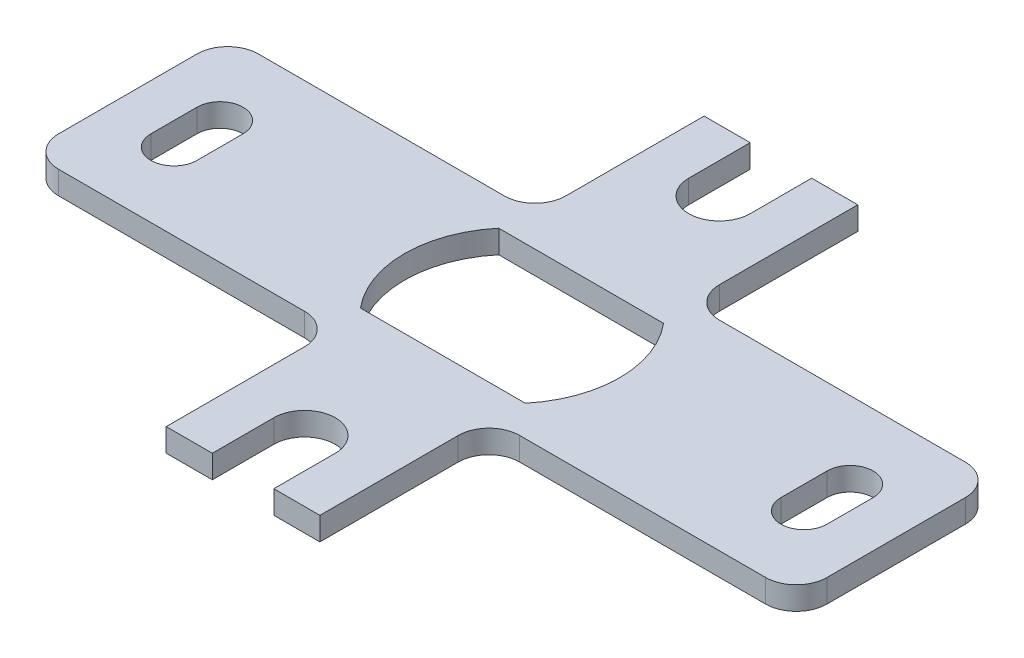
ISO-10303-21;
HEADER;
FILE_DESCRIPTION(('STEP AP214'),'2;1');
FILE_NAME('part.step','',(''),(''),'','','');
FILE_SCHEMA(('AUTOMOTIVE_DESIGN { 1 0 10303 214 1 1 1 1 }'));
ENDSEC;
DATA;
#1=APPLICATION_CONTEXT('core data for automotive mechanical design processes');
#2=APPLICATION_PROTOCOL_DEFINITION('international standard','automotive_design',2000,#1);
#3=PRODUCT_CONTEXT('',#1,'mechanical');
#4=PRODUCT('Part','Part','',(#3));
#5=PRODUCT_RELATED_PRODUCT_CATEGORY('part','',(#4));
#6=PRODUCT_DEFINITION_FORMATION('','',#4);
#7=PRODUCT_DEFINITION_CONTEXT('part definition',#1,'design');
#8=PRODUCT_DEFINITION('design','',#6,#7);
#9=PRODUCT_DEFINITION_SHAPE('','',#8);
#10=(LENGTH_UNIT() NAMED_UNIT(*) SI_UNIT(.MILLI.,.METRE.));
#11=(NAMED_UNIT(*) PLANE_ANGLE_UNIT() SI_UNIT($,.RADIAN.));
#12=(NAMED_UNIT(*) SI_UNIT($,.STERADIAN.) SOLID_ANGLE_UNIT());
#13=UNCERTAINTY_MEASURE_WITH_UNIT(LENGTH_MEASURE(1.E-05),#10,'distance_accuracy_value','');
#14=(GEOMETRIC_REPRESENTATION_CONTEXT(3) GLOBAL_UNCERTAINTY_ASSIGNED_CONTEXT((#13)) GLOBAL_UNIT_ASSIGNED_CONTEXT((#10,
#11,#12)) REPRESENTATION_CONTEXT('',''));
#15=CARTESIAN_POINT('',(0.,0.,0.));
#16=DIRECTION('',(0.,0.,1.));
#17=DIRECTION('',(1.,0.,0.));
#18=AXIS2_PLACEMENT_3D('',#15,#16,#17);
#19=CARTESIAN_POINT('',(4.,3.,-26.));
#20=DIRECTION('',(0.,1.,0.));
#21=DIRECTION('',(0.,0.,1.));
#22=AXIS2_PLACEMENT_3D('',#19,#20,#21);
#23=PLANE('',#22);
#24=DIRECTION('',(0.,0.,1.));
#25=VECTOR('',#24,1.);
#26=CARTESIAN_POINT('',(88.,3.,-32.));
#27=LINE('',#26,#25);
#28=CARTESIAN_POINT('',(88.,3.,-38.));
#29=VERTEX_POINT('',#28);
#30=CARTESIAN_POINT('',(88.,3.,-32.));
#31=VERTEX_POINT('',#30);
#32=EDGE_CURVE('E326',#29,#31,#27,.T.);
#33=ORIENTED_EDGE('',*,*,#32,.F.);
#34=CARTESIAN_POINT('',(91.,3.,-38.));
#35=DIRECTION('',(0.,1.,0.));
#36=DIRECTION('',(0.,0.,1.));
#37=AXIS2_PLACEMENT_3D('',#34,#35,#36);
#38=CIRCLE('',#37,3.);
#39=CARTESIAN_POINT('',(94.,3.,-38.));
#40=VERTEX_POINT('',#39);
#41=EDGE_CURVE('E324',#40,#29,#38,.T.);
#42=ORIENTED_EDGE('',*,*,#41,.F.);
#43=DIRECTION('',(0.,0.,-1.));
#44=VECTOR('',#43,1.);
#45=CARTESIAN_POINT('',(94.,3.,-38.));
#46=LINE('',#45,#44);
#47=CARTESIAN_POINT('',(94.,3.,-32.));
#48=VERTEX_POINT('',#47);
#49=EDGE_CURVE('E332',#48,#40,#46,.T.);
#50=ORIENTED_EDGE('',*,*,#49,.F.);
#51=CARTESIAN_POINT('',(91.,3.,-32.));
#52=DIRECTION('',(0.,1.,0.));
#53=DIRECTION('',(0.,0.,1.));
#54=AXIS2_PLACEMENT_3D('',#51,#52,#53);
#55=CIRCLE('',#54,3.);
#56=EDGE_CURVE('E329',#31,#48,#55,.T.);
#57=ORIENTED_EDGE('',*,*,#56,.F.);
#58=EDGE_LOOP('',(#33,#42,#50,#57));
#59=FACE_BOUND('',#58,.T.);
#60=CARTESIAN_POINT('',(4.,3.,-26.));
#61=DIRECTION('',(0.,1.,0.));
#62=DIRECTION('',(0.,0.,1.));
#63=AXIS2_PLACEMENT_3D('',#60,#61,#62);
#64=CIRCLE('',#63,4.);
#65=CARTESIAN_POINT('',(0.,3.,-26.));
#66=VERTEX_POINT('',#65);
#67=CARTESIAN_POINT('',(4.,3.,-22.));
#68=VERTEX_POINT('',#67);
#69=EDGE_CURVE('E386',#66,#68,#64,.T.);
#70=ORIENTED_EDGE('',*,*,#69,.T.);
#71=DIRECTION('',(1.,0.,0.));
#72=VECTOR('',#71,1.);
#73=CARTESIAN_POINT('',(4.,3.,-22.));
#74=LINE('',#73,#72);
#75=CARTESIAN_POINT('',(36.,3.,-22.));
#76=VERTEX_POINT('',#75);
#77=EDGE_CURVE('E389',#68,#76,#74,.T.);
#78=ORIENTED_EDGE('',*,*,#77,.T.);
#79=CARTESIAN_POINT('',(36.,3.,-18.));
#80=DIRECTION('',(0.,-1.,0.));
#81=DIRECTION('',(0.,0.,1.));
#82=AXIS2_PLACEMENT_3D('',#79,#80,#81);
#83=CIRCLE('',#82,4.);
#84=CARTESIAN_POINT('',(40.,3.,-18.));
#85=VERTEX_POINT('',#84);
#86=EDGE_CURVE('E392',#76,#85,#83,.T.);
#87=ORIENTED_EDGE('',*,*,#86,.T.);
#88=DIRECTION('',(0.,0.,1.));
#89=VECTOR('',#88,1.);
#90=CARTESIAN_POINT('',(40.,3.,0.));
#91=LINE('',#90,#89);
#92=CARTESIAN_POINT('',(40.,3.,0.));
#93=VERTEX_POINT('',#92);
#94=EDGE_CURVE('E394',#85,#93,#91,.T.);
#95=ORIENTED_EDGE('',*,*,#94,.T.);
#96=DIRECTION('',(1.,0.,0.));
#97=VECTOR('',#96,1.);
#98=CARTESIAN_POINT('',(40.,3.,0.));
#99=LINE('',#98,#97);
#100=CARTESIAN_POINT('',(46.,3.,0.));
#101=VERTEX_POINT('',#100);
#102=EDGE_CURVE('E396',#93,#101,#99,.T.);
#103=ORIENTED_EDGE('',*,*,#102,.T.);
#104=DIRECTION('',(0.,0.,-1.));
#105=VECTOR('',#104,1.);
#106=CARTESIAN_POINT('',(46.,3.,-8.));
#107=LINE('',#106,#105);
#108=CARTESIAN_POINT('',(46.,3.,-8.));
#109=VERTEX_POINT('',#108);
#110=EDGE_CURVE('E398',#101,#109,#107,.T.);
#111=ORIENTED_EDGE('',*,*,#110,.T.);
#112=CARTESIAN_POINT('',(50.,3.,-8.));
#113=DIRECTION('',(0.,-1.,0.));
#114=DIRECTION('',(0.,0.,1.));
#115=AXIS2_PLACEMENT_3D('',#112,#113,#114);
#116=CIRCLE('',#115,4.);
#117=CARTESIAN_POINT('',(54.,3.,-8.));
#118=VERTEX_POINT('',#117);
#119=EDGE_CURVE('E400',#109,#118,#116,.T.);
#120=ORIENTED_EDGE('',*,*,#119,.T.);
#121=DIRECTION('',(0.,0.,1.));
#122=VECTOR('',#121,1.);
#123=CARTESIAN_POINT('',(54.,3.,-8.));
#124=LINE('',#123,#122);
#125=CARTESIAN_POINT('',(54.,3.,0.));
#126=VERTEX_POINT('',#125);
#127=EDGE_CURVE('E402',#118,#126,#124,.T.);
#128=ORIENTED_EDGE('',*,*,#127,.T.);
#129=DIRECTION('',(1.,0.,0.));
#130=VECTOR('',#129,1.);
#131=CARTESIAN_POINT('',(54.,3.,0.));
#132=LINE('',#131,#130);
#133=CARTESIAN_POINT('',(60.,3.,0.));
#134=VERTEX_POINT('',#133);
#135=EDGE_CURVE('E404',#126,#134,#132,.T.);
#136=ORIENTED_EDGE('',*,*,#135,.T.);
#137=DIRECTION('',(0.,0.,-1.));
#138=VECTOR('',#137,1.);
#139=CARTESIAN_POINT('',(60.,3.,-18.));
#140=LINE('',#139,#138);
#141=CARTESIAN_POINT('',(60.,3.,-18.));
#142=VERTEX_POINT('',#141);
#143=EDGE_CURVE('E406',#134,#142,#140,.T.);
#144=ORIENTED_EDGE('',*,*,#143,.T.);
#145=CARTESIAN_POINT('',(64.,3.,-18.));
#146=DIRECTION('',(0.,-1.,0.));
#147=DIRECTION('',(0.,0.,-1.));
#148=AXIS2_PLACEMENT_3D('',#145,#146,#147);
#149=CIRCLE('',#148,4.00000000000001);
#150=CARTESIAN_POINT('',(64.,3.,-22.));
#151=VERTEX_POINT('',#150);
#152=EDGE_CURVE('E408',#142,#151,#149,.T.);
#153=ORIENTED_EDGE('',*,*,#152,.T.);
#154=DIRECTION('',(1.,0.,0.));
#155=VECTOR('',#154,1.);
#156=CARTESIAN_POINT('',(64.,3.,-22.));
#157=LINE('',#156,#155);
#158=CARTESIAN_POINT('',(96.,3.,-22.));
#159=VERTEX_POINT('',#158);
#160=EDGE_CURVE('E410',#151,#159,#157,.T.);
#161=ORIENTED_EDGE('',*,*,#160,.T.);
#162=CARTESIAN_POINT('',(96.,3.,-26.));
#163=DIRECTION('',(0.,1.,0.));
#164=DIRECTION('',(0.,0.,1.));
#165=AXIS2_PLACEMENT_3D('',#162,#163,#164);
#166=CIRCLE('',#165,4.);
#167=CARTESIAN_POINT('',(100.,3.,-26.));
#168=VERTEX_POINT('',#167);
#169=EDGE_CURVE('E412',#159,#168,#166,.T.);
#170=ORIENTED_EDGE('',*,*,#169,.T.);
#171=DIRECTION('',(0.,0.,-1.));
#172=VECTOR('',#171,1.);
#173=CARTESIAN_POINT('',(100.,3.,-26.));
#174=LINE('',#173,#172);
#175=CARTESIAN_POINT('',(100.,3.,-44.));
#176=VERTEX_POINT('',#175);
#177=EDGE_CURVE('E414',#168,#176,#174,.T.);
#178=ORIENTED_EDGE('',*,*,#177,.T.);
#179=CARTESIAN_POINT('',(96.,3.,-44.));
#180=DIRECTION('',(0.,1.,0.));
#181=DIRECTION('',(0.,0.,1.));
#182=AXIS2_PLACEMENT_3D('',#179,#180,#181);
#183=CIRCLE('',#182,4.);
#184=CARTESIAN_POINT('',(96.,3.,-48.));
#185=VERTEX_POINT('',#184);
#186=EDGE_CURVE('E416',#176,#185,#183,.T.);
#187=ORIENTED_EDGE('',*,*,#186,.T.);
#188=DIRECTION('',(-1.,0.,0.));
#189=VECTOR('',#188,1.);
#190=CARTESIAN_POINT('',(64.,3.,-48.));
#191=LINE('',#190,#189);
#192=CARTESIAN_POINT('',(64.,3.,-48.));
#193=VERTEX_POINT('',#192);
#194=EDGE_CURVE('E418',#185,#193,#191,.T.);
#195=ORIENTED_EDGE('',*,*,#194,.T.);
#196=CARTESIAN_POINT('',(64.,3.,-52.));
#197=DIRECTION('',(0.,-1.,0.));
#198=DIRECTION('',(0.,0.,-1.));
#199=AXIS2_PLACEMENT_3D('',#196,#197,#198);
#200=CIRCLE('',#199,4.);
#201=CARTESIAN_POINT('',(60.,3.,-52.));
#202=VERTEX_POINT('',#201);
#203=EDGE_CURVE('E420',#193,#202,#200,.T.);
#204=ORIENTED_EDGE('',*,*,#203,.T.);
#205=DIRECTION('',(0.,0.,-1.));
#206=VECTOR('',#205,1.);
#207=CARTESIAN_POINT('',(60.,3.,-70.));
#208=LINE('',#207,#206);
#209=CARTESIAN_POINT('',(60.,3.,-70.));
#210=VERTEX_POINT('',#209);
#211=EDGE_CURVE('E422',#202,#210,#208,.T.);
#212=ORIENTED_EDGE('',*,*,#211,.T.);
#213=DIRECTION('',(-1.,0.,0.));
#214=VECTOR('',#213,1.);
#215=CARTESIAN_POINT('',(54.,3.,-70.));
#216=LINE('',#215,#214);
#217=CARTESIAN_POINT('',(54.,3.,-70.));
#218=VERTEX_POINT('',#217);
#219=EDGE_CURVE('E424',#210,#218,#216,.T.);
#220=ORIENTED_EDGE('',*,*,#219,.T.);
#221=DIRECTION('',(0.,0.,1.));
#222=VECTOR('',#221,1.);
#223=CARTESIAN_POINT('',(54.,3.,-62.));
#224=LINE('',#223,#222);
#225=CARTESIAN_POINT('',(54.,3.,-62.));
#226=VERTEX_POINT('',#225);
#227=EDGE_CURVE('E426',#218,#226,#224,.T.);
#228=ORIENTED_EDGE('',*,*,#227,.T.);
#229=CARTESIAN_POINT('',(50.,3.,-62.));
#230=DIRECTION('',(0.,-1.,0.));
#231=DIRECTION('',(0.,0.,1.));
#232=AXIS2_PLACEMENT_3D('',#229,#230,#231);
#233=CIRCLE('',#232,3.99999999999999);
#234=CARTESIAN_POINT('',(46.,3.,-62.));
#235=VERTEX_POINT('',#234);
#236=EDGE_CURVE('E428',#226,#235,#233,.T.);
#237=ORIENTED_EDGE('',*,*,#236,.T.);
#238=DIRECTION('',(0.,0.,-1.));
#239=VECTOR('',#238,1.);
#240=CARTESIAN_POINT('',(46.,3.,-62.));
#241=LINE('',#240,#239);
#242=CARTESIAN_POINT('',(46.,3.,-70.));
#243=VERTEX_POINT('',#242);
#244=EDGE_CURVE('E430',#235,#243,#241,.T.);
#245=ORIENTED_EDGE('',*,*,#244,.T.);
#246=DIRECTION('',(-1.,0.,0.));
#247=VECTOR('',#246,1.);
#248=CARTESIAN_POINT('',(46.,3.,-70.));
#249=LINE('',#248,#247);
#250=CARTESIAN_POINT('',(40.,3.,-70.));
#251=VERTEX_POINT('',#250);
#252=EDGE_CURVE('E432',#243,#251,#249,.T.);
#253=ORIENTED_EDGE('',*,*,#252,.T.);
#254=DIRECTION('',(0.,0.,1.));
#255=VECTOR('',#254,1.);
#256=CARTESIAN_POINT('',(40.,3.,-52.));
#257=LINE('',#256,#255);
#258=CARTESIAN_POINT('',(40.,3.,-52.));
#259=VERTEX_POINT('',#258);
#260=EDGE_CURVE('E434',#251,#259,#257,.T.);
#261=ORIENTED_EDGE('',*,*,#260,.T.);
#262=CARTESIAN_POINT('',(36.,3.,-52.));
#263=DIRECTION('',(0.,-1.,0.));
#264=DIRECTION('',(0.,0.,-1.));
#265=AXIS2_PLACEMENT_3D('',#262,#263,#264);
#266=CIRCLE('',#265,3.99999999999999);
#267=CARTESIAN_POINT('',(36.,3.,-48.));
#268=VERTEX_POINT('',#267);
#269=EDGE_CURVE('E436',#259,#268,#266,.T.);
#270=ORIENTED_EDGE('',*,*,#269,.T.);
#271=DIRECTION('',(-1.,0.,0.));
#272=VECTOR('',#271,1.);
#273=CARTESIAN_POINT('',(4.,3.,-48.));
#274=LINE('',#273,#272);
#275=CARTESIAN_POINT('',(4.,3.,-48.));
#276=VERTEX_POINT('',#275);
#277=EDGE_CURVE('E438',#268,#276,#274,.T.);
#278=ORIENTED_EDGE('',*,*,#277,.T.);
#279=CARTESIAN_POINT('',(4.,3.,-44.));
#280=DIRECTION('',(0.,1.,0.));
#281=DIRECTION('',(0.,0.,1.));
#282=AXIS2_PLACEMENT_3D('',#279,#280,#281);
#283=CIRCLE('',#282,4.);
#284=CARTESIAN_POINT('',(0.,3.,-44.));
#285=VERTEX_POINT('',#284);
#286=EDGE_CURVE('E440',#276,#285,#283,.T.);
#287=ORIENTED_EDGE('',*,*,#286,.T.);
#288=DIRECTION('',(0.,0.,1.));
#289=VECTOR('',#288,1.);
#290=CARTESIAN_POINT('',(0.,3.,-26.));
#291=LINE('',#290,#289);
#292=EDGE_CURVE('E442',#285,#66,#291,.T.);
#293=ORIENTED_EDGE('',*,*,#292,.T.);
#294=EDGE_LOOP('',(#70,#78,#87,#95,#103,#111,#120,#128,#136,#144,#153,#161,#170,#178,#187,#195,
#204,#212,#220,#228,#237,#245,#253,#261,#270,#278,#287,#293));
#295=FACE_BOUND('',#294,.T.);
#296=DIRECTION('',(1.,0.,0.));
#297=VECTOR('',#296,1.);
#298=CARTESIAN_POINT('',(60.7238052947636,3.,-26.));
#299=LINE('',#298,#297);
#300=CARTESIAN_POINT('',(39.2761947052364,3.,-26.));
#301=VERTEX_POINT('',#300);
#302=CARTESIAN_POINT('',(60.7238052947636,3.,-26.));
#303=VERTEX_POINT('',#302);
#304=EDGE_CURVE('E357',#301,#303,#299,.T.);
#305=ORIENTED_EDGE('',*,*,#304,.F.);
#306=CARTESIAN_POINT('',(50.,3.,-35.));
#307=DIRECTION('',(0.,1.,0.));
#308=DIRECTION('',(0.,0.,1.));
#309=AXIS2_PLACEMENT_3D('',#306,#307,#308);
#310=CIRCLE('',#309,14.);
#311=CARTESIAN_POINT('',(39.2761947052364,3.,-44.));
#312=VERTEX_POINT('',#311);
#313=EDGE_CURVE('E355',#312,#301,#310,.T.);
#314=ORIENTED_EDGE('',*,*,#313,.F.);
#315=DIRECTION('',(-1.,0.,0.));
#316=VECTOR('',#315,1.);
#317=CARTESIAN_POINT('',(39.2761947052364,3.,-44.));
#318=LINE('',#317,#316);
#319=CARTESIAN_POINT('',(60.7238052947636,3.,-44.));
#320=VERTEX_POINT('',#319);
#321=EDGE_CURVE('E363',#320,#312,#318,.T.);
#322=ORIENTED_EDGE('',*,*,#321,.F.);
#323=CARTESIAN_POINT('',(50.,3.,-35.));
#324=DIRECTION('',(0.,1.,0.));
#325=DIRECTION('',(0.,0.,1.));
#326=AXIS2_PLACEMENT_3D('',#323,#324,#325);
#327=CIRCLE('',#326,14.);
#328=EDGE_CURVE('E360',#303,#320,#327,.T.);
#329=ORIENTED_EDGE('',*,*,#328,.F.);
#330=EDGE_LOOP('',(#305,#314,#322,#329));
#331=FACE_BOUND('',#330,.T.);
#332=DIRECTION('',(0.,0.,1.));
#333=VECTOR('',#332,1.);
#334=CARTESIAN_POINT('',(6.,3.,-38.));
#335=LINE('',#334,#333);
#336=CARTESIAN_POINT('',(6.,3.,-38.));
#337=VERTEX_POINT('',#336);
#338=CARTESIAN_POINT('',(6.,3.,-32.));
#339=VERTEX_POINT('',#338);
#340=EDGE_CURVE('E296',#337,#339,#335,.T.);
#341=ORIENTED_EDGE('',*,*,#340,.F.);
#342=CARTESIAN_POINT('',(8.99999999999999,3.,-38.));
#343=DIRECTION('',(0.,1.,0.));
#344=DIRECTION('',(0.,0.,1.));
#345=AXIS2_PLACEMENT_3D('',#342,#343,#344);
#346=CIRCLE('',#345,3.);
#347=CARTESIAN_POINT('',(12.,3.,-38.));
#348=VERTEX_POINT('',#347);
#349=EDGE_CURVE('E288',#348,#337,#346,.T.);
#350=ORIENTED_EDGE('',*,*,#349,.F.);
#351=DIRECTION('',(0.,0.,-1.));
#352=VECTOR('',#351,1.);
#353=CARTESIAN_POINT('',(12.,3.,-38.));
#354=LINE('',#353,#352);
#355=CARTESIAN_POINT('',(12.,3.,-32.));
#356=VERTEX_POINT('',#355);
#357=EDGE_CURVE('E310',#356,#348,#354,.T.);
#358=ORIENTED_EDGE('',*,*,#357,.F.);
#359=CARTESIAN_POINT('',(9.,3.,-32.));
#360=DIRECTION('',(0.,1.,0.));
#361=DIRECTION('',(0.,0.,1.));
#362=AXIS2_PLACEMENT_3D('',#359,#360,#361);
#363=CIRCLE('',#362,3.);
#364=EDGE_CURVE('E308',#339,#356,#363,.T.);
#365=ORIENTED_EDGE('',*,*,#364,.F.);
#366=EDGE_LOOP('',(#341,#350,#358,#365));
#367=FACE_BOUND('',#366,.T.);
#368=ADVANCED_FACE('F31',(#59,#295,#331,#367),#23,.T.);
#369=CARTESIAN_POINT('',(4.,0.,-26.));
#370=DIRECTION('',(0.,1.,0.));
#371=DIRECTION('',(0.,0.,1.));
#372=AXIS2_PLACEMENT_3D('',#369,#370,#371);
#373=PLANE('',#372);
#374=CARTESIAN_POINT('',(91.,0.,-38.));
#375=DIRECTION('',(0.,1.,0.));
#376=DIRECTION('',(0.,0.,1.));
#377=AXIS2_PLACEMENT_3D('',#374,#375,#376);
#378=CIRCLE('',#377,3.);
#379=CARTESIAN_POINT('',(94.,0.,-38.));
#380=VERTEX_POINT('',#379);
#381=CARTESIAN_POINT('',(88.,0.,-38.));
#382=VERTEX_POINT('',#381);
#383=EDGE_CURVE('E304',#380,#382,#378,.T.);
#384=ORIENTED_EDGE('',*,*,#383,.T.);
#385=DIRECTION('',(0.,0.,1.));
#386=VECTOR('',#385,1.);
#387=CARTESIAN_POINT('',(88.,0.,-32.));
#388=LINE('',#387,#386);
#389=CARTESIAN_POINT('',(88.,0.,-32.));
#390=VERTEX_POINT('',#389);
#391=EDGE_CURVE('E337',#382,#390,#388,.T.);
#392=ORIENTED_EDGE('',*,*,#391,.T.);
#393=CARTESIAN_POINT('',(91.,0.,-32.));
#394=DIRECTION('',(0.,1.,0.));
#395=DIRECTION('',(0.,0.,1.));
#396=AXIS2_PLACEMENT_3D('',#393,#394,#395);
#397=CIRCLE('',#396,3.);
#398=CARTESIAN_POINT('',(94.,0.,-32.));
#399=VERTEX_POINT('',#398);
#400=EDGE_CURVE('E340',#390,#399,#397,.T.);
#401=ORIENTED_EDGE('',*,*,#400,.T.);
#402=DIRECTION('',(0.,0.,-1.));
#403=VECTOR('',#402,1.);
#404=CARTESIAN_POINT('',(94.,0.,-38.));
#405=LINE('',#404,#403);
#406=EDGE_CURVE('E327',#399,#380,#405,.T.);
#407=ORIENTED_EDGE('',*,*,#406,.T.);
#408=EDGE_LOOP('',(#384,#392,#401,#407));
#409=FACE_BOUND('',#408,.T.);
#410=CARTESIAN_POINT('',(4.,0.,-26.));
#411=DIRECTION('',(0.,1.,0.));
#412=DIRECTION('',(0.,0.,1.));
#413=AXIS2_PLACEMENT_3D('',#410,#411,#412);
#414=CIRCLE('',#413,4.);
#415=CARTESIAN_POINT('',(0.,0.,-26.));
#416=VERTEX_POINT('',#415);
#417=CARTESIAN_POINT('',(4.,0.,-22.));
#418=VERTEX_POINT('',#417);
#419=EDGE_CURVE('E385',#416,#418,#414,.T.);
#420=ORIENTED_EDGE('',*,*,#419,.F.);
#421=DIRECTION('',(0.,0.,1.));
#422=VECTOR('',#421,1.);
#423=CARTESIAN_POINT('',(0.,0.,-26.));
#424=LINE('',#423,#422);
#425=CARTESIAN_POINT('',(0.,0.,-44.));
#426=VERTEX_POINT('',#425);
#427=EDGE_CURVE('E390',#426,#416,#424,.T.);
#428=ORIENTED_EDGE('',*,*,#427,.F.);
#429=CARTESIAN_POINT('',(4.,0.,-44.));
#430=DIRECTION('',(0.,1.,0.));
#431=DIRECTION('',(0.,0.,1.));
#432=AXIS2_PLACEMENT_3D('',#429,#430,#431);
#433=CIRCLE('',#432,4.);
#434=CARTESIAN_POINT('',(4.,0.,-48.));
#435=VERTEX_POINT('',#434);
#436=EDGE_CURVE('E497',#435,#426,#433,.T.);
#437=ORIENTED_EDGE('',*,*,#436,.F.);
#438=DIRECTION('',(-1.,0.,0.));
#439=VECTOR('',#438,1.);
#440=CARTESIAN_POINT('',(4.,0.,-48.));
#441=LINE('',#440,#439);
#442=CARTESIAN_POINT('',(36.,0.,-48.));
#443=VERTEX_POINT('',#442);
#444=EDGE_CURVE('E495',#443,#435,#441,.T.);
#445=ORIENTED_EDGE('',*,*,#444,.F.);
#446=CARTESIAN_POINT('',(36.,0.,-52.));
#447=DIRECTION('',(0.,-1.,0.));
#448=DIRECTION('',(0.,0.,-1.));
#449=AXIS2_PLACEMENT_3D('',#446,#447,#448);
#450=CIRCLE('',#449,3.99999999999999);
#451=CARTESIAN_POINT('',(40.,0.,-52.));
#452=VERTEX_POINT('',#451);
#453=EDGE_CURVE('E493',#452,#443,#450,.T.);
#454=ORIENTED_EDGE('',*,*,#453,.F.);
#455=DIRECTION('',(0.,0.,1.));
#456=VECTOR('',#455,1.);
#457=CARTESIAN_POINT('',(40.,0.,-52.));
#458=LINE('',#457,#456);
#459=CARTESIAN_POINT('',(40.,0.,-70.));
#460=VERTEX_POINT('',#459);
#461=EDGE_CURVE('E491',#460,#452,#458,.T.);
#462=ORIENTED_EDGE('',*,*,#461,.F.);
#463=DIRECTION('',(-1.,0.,0.));
#464=VECTOR('',#463,1.);
#465=CARTESIAN_POINT('',(46.,0.,-70.));
#466=LINE('',#465,#464);
#467=CARTESIAN_POINT('',(46.,0.,-70.));
#468=VERTEX_POINT('',#467);
#469=EDGE_CURVE('E489',#468,#460,#466,.T.);
#470=ORIENTED_EDGE('',*,*,#469,.F.);
#471=DIRECTION('',(0.,0.,-1.));
#472=VECTOR('',#471,1.);
#473=CARTESIAN_POINT('',(46.,0.,-62.));
#474=LINE('',#473,#472);
#475=CARTESIAN_POINT('',(46.,0.,-62.));
#476=VERTEX_POINT('',#475);
#477=EDGE_CURVE('E487',#476,#468,#474,.T.);
#478=ORIENTED_EDGE('',*,*,#477,.F.);
#479=CARTESIAN_POINT('',(50.,0.,-62.));
#480=DIRECTION('',(0.,-1.,0.));
#481=DIRECTION('',(0.,0.,1.));
#482=AXIS2_PLACEMENT_3D('',#479,#480,#481);
#483=CIRCLE('',#482,3.99999999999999);
#484=CARTESIAN_POINT('',(54.,0.,-62.));
#485=VERTEX_POINT('',#484);
#486=EDGE_CURVE('E485',#485,#476,#483,.T.);
#487=ORIENTED_EDGE('',*,*,#486,.F.);
#488=DIRECTION('',(0.,0.,1.));
#489=VECTOR('',#488,1.);
#490=CARTESIAN_POINT('',(54.,0.,-62.));
#491=LINE('',#490,#489);
#492=CARTESIAN_POINT('',(54.,0.,-70.));
#493=VERTEX_POINT('',#492);
#494=EDGE_CURVE('E483',#493,#485,#491,.T.);
#495=ORIENTED_EDGE('',*,*,#494,.F.);
#496=DIRECTION('',(-1.,0.,0.));
#497=VECTOR('',#496,1.);
#498=CARTESIAN_POINT('',(54.,0.,-70.));
#499=LINE('',#498,#497);
#500=CARTESIAN_POINT('',(60.,0.,-70.));
#501=VERTEX_POINT('',#500);
#502=EDGE_CURVE('E481',#501,#493,#499,.T.);
#503=ORIENTED_EDGE('',*,*,#502,.F.);
#504=DIRECTION('',(0.,0.,-1.));
#505=VECTOR('',#504,1.);
#506=CARTESIAN_POINT('',(60.,0.,-70.));
#507=LINE('',#506,#505);
#508=CARTESIAN_POINT('',(60.,0.,-52.));
#509=VERTEX_POINT('',#508);
#510=EDGE_CURVE('E479',#509,#501,#507,.T.);
#511=ORIENTED_EDGE('',*,*,#510,.F.);
#512=CARTESIAN_POINT('',(64.,0.,-52.));
#513=DIRECTION('',(0.,-1.,0.));
#514=DIRECTION('',(0.,0.,-1.));
#515=AXIS2_PLACEMENT_3D('',#512,#513,#514);
#516=CIRCLE('',#515,4.);
#517=CARTESIAN_POINT('',(64.,0.,-48.));
#518=VERTEX_POINT('',#517);
#519=EDGE_CURVE('E477',#518,#509,#516,.T.);
#520=ORIENTED_EDGE('',*,*,#519,.F.);
#521=DIRECTION('',(-1.,0.,0.));
#522=VECTOR('',#521,1.);
#523=CARTESIAN_POINT('',(64.,0.,-48.));
#524=LINE('',#523,#522);
#525=CARTESIAN_POINT('',(96.,0.,-48.));
#526=VERTEX_POINT('',#525);
#527=EDGE_CURVE('E475',#526,#518,#524,.T.);
#528=ORIENTED_EDGE('',*,*,#527,.F.);
#529=CARTESIAN_POINT('',(96.,0.,-44.));
#530=DIRECTION('',(0.,1.,0.));
#531=DIRECTION('',(0.,0.,1.));
#532=AXIS2_PLACEMENT_3D('',#529,#530,#531);
#533=CIRCLE('',#532,4.);
#534=CARTESIAN_POINT('',(100.,0.,-44.));
#535=VERTEX_POINT('',#534);
#536=EDGE_CURVE('E473',#535,#526,#533,.T.);
#537=ORIENTED_EDGE('',*,*,#536,.F.);
#538=DIRECTION('',(0.,0.,-1.));
#539=VECTOR('',#538,1.);
#540=CARTESIAN_POINT('',(100.,0.,-26.));
#541=LINE('',#540,#539);
#542=CARTESIAN_POINT('',(100.,0.,-26.));
#543=VERTEX_POINT('',#542);
#544=EDGE_CURVE('E471',#543,#535,#541,.T.);
#545=ORIENTED_EDGE('',*,*,#544,.F.);
#546=CARTESIAN_POINT('',(96.,0.,-26.));
#547=DIRECTION('',(0.,1.,0.));
#548=DIRECTION('',(0.,0.,1.));
#549=AXIS2_PLACEMENT_3D('',#546,#547,#548);
#550=CIRCLE('',#549,4.);
#551=CARTESIAN_POINT('',(96.,0.,-22.));
#552=VERTEX_POINT('',#551);
#553=EDGE_CURVE('E469',#552,#543,#550,.T.);
#554=ORIENTED_EDGE('',*,*,#553,.F.);
#555=DIRECTION('',(1.,0.,0.));
#556=VECTOR('',#555,1.);
#557=CARTESIAN_POINT('',(64.,0.,-22.));
#558=LINE('',#557,#556);
#559=CARTESIAN_POINT('',(64.,0.,-22.));
#560=VERTEX_POINT('',#559);
#561=EDGE_CURVE('E467',#560,#552,#558,.T.);
#562=ORIENTED_EDGE('',*,*,#561,.F.);
#563=CARTESIAN_POINT('',(64.,0.,-18.));
#564=DIRECTION('',(0.,-1.,0.));
#565=DIRECTION('',(0.,0.,-1.));
#566=AXIS2_PLACEMENT_3D('',#563,#564,#565);
#567=CIRCLE('',#566,4.00000000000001);
#568=CARTESIAN_POINT('',(60.,0.,-18.));
#569=VERTEX_POINT('',#568);
#570=EDGE_CURVE('E465',#569,#560,#567,.T.);
#571=ORIENTED_EDGE('',*,*,#570,.F.);
#572=DIRECTION('',(0.,0.,-1.));
#573=VECTOR('',#572,1.);
#574=CARTESIAN_POINT('',(60.,0.,-18.));
#575=LINE('',#574,#573);
#576=CARTESIAN_POINT('',(60.,0.,0.));
#577=VERTEX_POINT('',#576);
#578=EDGE_CURVE('E463',#577,#569,#575,.T.);
#579=ORIENTED_EDGE('',*,*,#578,.F.);
#580=DIRECTION('',(1.,0.,0.));
#581=VECTOR('',#580,1.);
#582=CARTESIAN_POINT('',(54.,0.,0.));
#583=LINE('',#582,#581);
#584=CARTESIAN_POINT('',(54.,0.,0.));
#585=VERTEX_POINT('',#584);
#586=EDGE_CURVE('E461',#585,#577,#583,.T.);
#587=ORIENTED_EDGE('',*,*,#586,.F.);
#588=DIRECTION('',(0.,0.,1.));
#589=VECTOR('',#588,1.);
#590=CARTESIAN_POINT('',(54.,0.,-8.));
#591=LINE('',#590,#589);
#592=CARTESIAN_POINT('',(54.,0.,-8.));
#593=VERTEX_POINT('',#592);
#594=EDGE_CURVE('E459',#593,#585,#591,.T.);
#595=ORIENTED_EDGE('',*,*,#594,.F.);
#596=CARTESIAN_POINT('',(50.,0.,-8.));
#597=DIRECTION('',(0.,-1.,0.));
#598=DIRECTION('',(0.,0.,1.));
#599=AXIS2_PLACEMENT_3D('',#596,#597,#598);
#600=CIRCLE('',#599,4.);
#601=CARTESIAN_POINT('',(46.,0.,-8.));
#602=VERTEX_POINT('',#601);
#603=EDGE_CURVE('E457',#602,#593,#600,.T.);
#604=ORIENTED_EDGE('',*,*,#603,.F.);
#605=DIRECTION('',(0.,0.,-1.));
#606=VECTOR('',#605,1.);
#607=CARTESIAN_POINT('',(46.,0.,-8.));
#608=LINE('',#607,#606);
#609=CARTESIAN_POINT('',(46.,0.,0.));
#610=VERTEX_POINT('',#609);
#611=EDGE_CURVE('E455',#610,#602,#608,.T.);
#612=ORIENTED_EDGE('',*,*,#611,.F.);
#613=DIRECTION('',(1.,0.,0.));
#614=VECTOR('',#613,1.);
#615=CARTESIAN_POINT('',(40.,0.,0.));
#616=LINE('',#615,#614);
#617=CARTESIAN_POINT('',(40.,0.,0.));
#618=VERTEX_POINT('',#617);
#619=EDGE_CURVE('E453',#618,#610,#616,.T.);
#620=ORIENTED_EDGE('',*,*,#619,.F.);
#621=DIRECTION('',(0.,0.,1.));
#622=VECTOR('',#621,1.);
#623=CARTESIAN_POINT('',(40.,0.,0.));
#624=LINE('',#623,#622);
#625=CARTESIAN_POINT('',(40.,0.,-18.));
#626=VERTEX_POINT('',#625);
#627=EDGE_CURVE('E451',#626,#618,#624,.T.);
#628=ORIENTED_EDGE('',*,*,#627,.F.);
#629=CARTESIAN_POINT('',(36.,0.,-18.));
#630=DIRECTION('',(0.,-1.,0.));
#631=DIRECTION('',(0.,0.,1.));
#632=AXIS2_PLACEMENT_3D('',#629,#630,#631);
#633=CIRCLE('',#632,4.);
#634=CARTESIAN_POINT('',(36.,0.,-22.));
#635=VERTEX_POINT('',#634);
#636=EDGE_CURVE('E449',#635,#626,#633,.T.);
#637=ORIENTED_EDGE('',*,*,#636,.F.);
#638=DIRECTION('',(1.,0.,0.));
#639=VECTOR('',#638,1.);
#640=CARTESIAN_POINT('',(4.,0.,-22.));
#641=LINE('',#640,#639);
#642=EDGE_CURVE('E447',#418,#635,#641,.T.);
#643=ORIENTED_EDGE('',*,*,#642,.F.);
#644=EDGE_LOOP('',(#420,#428,#437,#445,#454,#462,#470,#478,#487,#495,#503,#511,#520,#528,#537,
#545,#554,#562,#571,#579,#587,#595,#604,#612,#620,#628,#637,#643));
#645=FACE_BOUND('',#644,.T.);
#646=CARTESIAN_POINT('',(50.,0.,-35.));
#647=DIRECTION('',(0.,1.,0.));
#648=DIRECTION('',(0.,0.,1.));
#649=AXIS2_PLACEMENT_3D('',#646,#647,#648);
#650=CIRCLE('',#649,14.);
#651=CARTESIAN_POINT('',(39.2761947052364,0.,-44.));
#652=VERTEX_POINT('',#651);
#653=CARTESIAN_POINT('',(39.2761947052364,0.,-26.));
#654=VERTEX_POINT('',#653);
#655=EDGE_CURVE('E354',#652,#654,#650,.T.);
#656=ORIENTED_EDGE('',*,*,#655,.T.);
#657=DIRECTION('',(1.,0.,0.));
#658=VECTOR('',#657,1.);
#659=CARTESIAN_POINT('',(60.7238052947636,0.,-26.));
#660=LINE('',#659,#658);
#661=CARTESIAN_POINT('',(60.7238052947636,0.,-26.));
#662=VERTEX_POINT('',#661);
#663=EDGE_CURVE('E368',#654,#662,#660,.T.);
#664=ORIENTED_EDGE('',*,*,#663,.T.);
#665=CARTESIAN_POINT('',(50.,0.,-35.));
#666=DIRECTION('',(0.,1.,0.));
#667=DIRECTION('',(0.,0.,1.));
#668=AXIS2_PLACEMENT_3D('',#665,#666,#667);
#669=CIRCLE('',#668,14.);
#670=CARTESIAN_POINT('',(60.7238052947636,0.,-44.));
#671=VERTEX_POINT('',#670);
#672=EDGE_CURVE('E371',#662,#671,#669,.T.);
#673=ORIENTED_EDGE('',*,*,#672,.T.);
#674=DIRECTION('',(-1.,0.,0.));
#675=VECTOR('',#674,1.);
#676=CARTESIAN_POINT('',(39.2761947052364,0.,-44.));
#677=LINE('',#676,#675);
#678=EDGE_CURVE('E358',#671,#652,#677,.T.);
#679=ORIENTED_EDGE('',*,*,#678,.T.);
#680=EDGE_LOOP('',(#656,#664,#673,#679));
#681=FACE_BOUND('',#680,.T.);
#682=CARTESIAN_POINT('',(8.99999999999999,0.,-38.));
#683=DIRECTION('',(0.,1.,0.));
#684=DIRECTION('',(0.,0.,1.));
#685=AXIS2_PLACEMENT_3D('',#682,#683,#684);
#686=CIRCLE('',#685,3.);
#687=CARTESIAN_POINT('',(12.,0.,-38.));
#688=VERTEX_POINT('',#687);
#689=CARTESIAN_POINT('',(6.,0.,-38.));
#690=VERTEX_POINT('',#689);
#691=EDGE_CURVE('E54',#688,#690,#686,.T.);
#692=ORIENTED_EDGE('',*,*,#691,.T.);
#693=DIRECTION('',(0.,0.,1.));
#694=VECTOR('',#693,1.);
#695=CARTESIAN_POINT('',(6.,0.,-38.));
#696=LINE('',#695,#694);
#697=CARTESIAN_POINT('',(6.,0.,-32.));
#698=VERTEX_POINT('',#697);
#699=EDGE_CURVE('E303',#690,#698,#696,.T.);
#700=ORIENTED_EDGE('',*,*,#699,.T.);
#701=CARTESIAN_POINT('',(9.,0.,-32.));
#702=DIRECTION('',(0.,1.,0.));
#703=DIRECTION('',(0.,0.,1.));
#704=AXIS2_PLACEMENT_3D('',#701,#702,#703);
#705=CIRCLE('',#704,3.);
#706=CARTESIAN_POINT('',(12.,0.,-32.));
#707=VERTEX_POINT('',#706);
#708=EDGE_CURVE('E316',#698,#707,#705,.T.);
#709=ORIENTED_EDGE('',*,*,#708,.T.);
#710=DIRECTION('',(0.,0.,-1.));
#711=VECTOR('',#710,1.);
#712=CARTESIAN_POINT('',(12.,0.,-38.));
#713=LINE('',#712,#711);
#714=EDGE_CURVE('E297',#707,#688,#713,.T.);
#715=ORIENTED_EDGE('',*,*,#714,.T.);
#716=EDGE_LOOP('',(#692,#700,#709,#715));
#717=FACE_BOUND('',#716,.T.);
#718=ADVANCED_FACE('F587',(#409,#645,#681,#717),#373,.F.);
#719=CARTESIAN_POINT('',(4.,3.,-26.));
#720=DIRECTION('',(0.,-1.,0.));
#721=DIRECTION('',(0.,0.,-1.));
#722=AXIS2_PLACEMENT_3D('',#719,#720,#721);
#723=CYLINDRICAL_SURFACE('',#722,4.);
#724=ORIENTED_EDGE('',*,*,#419,.T.);
#725=DIRECTION('',(0.,-1.,0.));
#726=VECTOR('',#725,1.);
#727=CARTESIAN_POINT('',(4.,3.,-22.));
#728=LINE('',#727,#726);
#729=EDGE_CURVE('E11',#68,#418,#728,.T.);
#730=ORIENTED_EDGE('',*,*,#729,.F.);
#731=ORIENTED_EDGE('',*,*,#69,.F.);
#732=DIRECTION('',(0.,-1.,0.));
#733=VECTOR('',#732,1.);
#734=CARTESIAN_POINT('',(0.,3.,-26.));
#735=LINE('',#734,#733);
#736=EDGE_CURVE('E444',#66,#416,#735,.T.);
#737=ORIENTED_EDGE('',*,*,#736,.T.);
#738=EDGE_LOOP('',(#724,#730,#731,#737));
#739=FACE_BOUND('',#738,.T.);
#740=ADVANCED_FACE('F33',(#739),#723,.T.);
#741=CARTESIAN_POINT('',(4.,3.,-22.));
#742=DIRECTION('',(0.,0.,-1.));
#743=DIRECTION('',(-1.,0.,0.));
#744=AXIS2_PLACEMENT_3D('',#741,#742,#743);
#745=PLANE('',#744);
#746=ORIENTED_EDGE('',*,*,#642,.T.);
#747=DIRECTION('',(0.,-1.,0.));
#748=VECTOR('',#747,1.);
#749=CARTESIAN_POINT('',(36.,3.,-22.));
#750=LINE('',#749,#748);
#751=EDGE_CURVE('E39',#76,#635,#750,.T.);
#752=ORIENTED_EDGE('',*,*,#751,.F.);
#753=ORIENTED_EDGE('',*,*,#77,.F.);
#754=ORIENTED_EDGE('',*,*,#729,.T.);
#755=EDGE_LOOP('',(#746,#752,#753,#754));
#756=FACE_BOUND('',#755,.T.);
#757=ADVANCED_FACE('F605',(#756),#745,.F.);
#758=CARTESIAN_POINT('',(36.,3.,-18.));
#759=DIRECTION('',(0.,-1.,0.));
#760=DIRECTION('',(0.,0.,-1.));
#761=AXIS2_PLACEMENT_3D('',#758,#759,#760);
#762=CYLINDRICAL_SURFACE('',#761,4.);
#763=ORIENTED_EDGE('',*,*,#636,.T.);
#764=DIRECTION('',(0.,-1.,0.));
#765=VECTOR('',#764,1.);
#766=CARTESIAN_POINT('',(40.,3.,-18.));
#767=LINE('',#766,#765);
#768=EDGE_CURVE('E574',#85,#626,#767,.T.);
#769=ORIENTED_EDGE('',*,*,#768,.F.);
#770=ORIENTED_EDGE('',*,*,#86,.F.);
#771=ORIENTED_EDGE('',*,*,#751,.T.);
#772=EDGE_LOOP('',(#763,#769,#770,#771));
#773=FACE_BOUND('',#772,.T.);
#774=ADVANCED_FACE('F581',(#773),#762,.F.);
#775=CARTESIAN_POINT('',(40.,3.,0.));
#776=DIRECTION('',(1.,0.,0.));
#777=DIRECTION('',(0.,0.,-1.));
#778=AXIS2_PLACEMENT_3D('',#775,#776,#777);
#779=PLANE('',#778);
#780=ORIENTED_EDGE('',*,*,#627,.T.);
#781=DIRECTION('',(0.,-1.,0.));
#782=VECTOR('',#781,1.);
#783=CARTESIAN_POINT('',(40.,3.,0.));
#784=LINE('',#783,#782);
#785=EDGE_CURVE('E571',#93,#618,#784,.T.);
#786=ORIENTED_EDGE('',*,*,#785,.F.);
#787=ORIENTED_EDGE('',*,*,#94,.F.);
#788=ORIENTED_EDGE('',*,*,#768,.T.);
#789=EDGE_LOOP('',(#780,#786,#787,#788));
#790=FACE_BOUND('',#789,.T.);
#791=ADVANCED_FACE('F593',(#790),#779,.F.);
#792=CARTESIAN_POINT('',(40.,3.,0.));
#793=DIRECTION('',(0.,0.,-1.));
#794=DIRECTION('',(-1.,0.,0.));
#795=AXIS2_PLACEMENT_3D('',#792,#793,#794);
#796=PLANE('',#795);
#797=ORIENTED_EDGE('',*,*,#619,.T.);
#798=DIRECTION('',(0.,-1.,0.));
#799=VECTOR('',#798,1.);
#800=CARTESIAN_POINT('',(46.,3.,0.));
#801=LINE('',#800,#799);
#802=EDGE_CURVE('E568',#101,#610,#801,.T.);
#803=ORIENTED_EDGE('',*,*,#802,.F.);
#804=ORIENTED_EDGE('',*,*,#102,.F.);
#805=ORIENTED_EDGE('',*,*,#785,.T.);
#806=EDGE_LOOP('',(#797,#803,#804,#805));
#807=FACE_BOUND('',#806,.T.);
#808=ADVANCED_FACE('F597',(#807),#796,.F.);
#809=CARTESIAN_POINT('',(46.,3.,-8.));
#810=DIRECTION('',(-1.,0.,0.));
#811=DIRECTION('',(0.,0.,1.));
#812=AXIS2_PLACEMENT_3D('',#809,#810,#811);
#813=PLANE('',#812);
#814=ORIENTED_EDGE('',*,*,#611,.T.);
#815=DIRECTION('',(0.,-1.,0.));
#816=VECTOR('',#815,1.);
#817=CARTESIAN_POINT('',(46.,3.,-8.));
#818=LINE('',#817,#816);
#819=EDGE_CURVE('E565',#109,#602,#818,.T.);
#820=ORIENTED_EDGE('',*,*,#819,.F.);
#821=ORIENTED_EDGE('',*,*,#110,.F.);
#822=ORIENTED_EDGE('',*,*,#802,.T.);
#823=EDGE_LOOP('',(#814,#820,#821,#822));
#824=FACE_BOUND('',#823,.T.);
#825=ADVANCED_FACE('F718',(#824),#813,.F.);
#826=CARTESIAN_POINT('',(50.,3.,-8.));
#827=DIRECTION('',(0.,-1.,0.));
#828=DIRECTION('',(0.,0.,-1.));
#829=AXIS2_PLACEMENT_3D('',#826,#827,#828);
#830=CYLINDRICAL_SURFACE('',#829,4.);
#831=ORIENTED_EDGE('',*,*,#603,.T.);
#832=DIRECTION('',(0.,-1.,0.));
#833=VECTOR('',#832,1.);
#834=CARTESIAN_POINT('',(54.,3.,-8.));
#835=LINE('',#834,#833);
#836=EDGE_CURVE('E562',#118,#593,#835,.T.);
#837=ORIENTED_EDGE('',*,*,#836,.F.);
#838=ORIENTED_EDGE('',*,*,#119,.F.);
#839=ORIENTED_EDGE('',*,*,#819,.T.);
#840=EDGE_LOOP('',(#831,#837,#838,#839));
#841=FACE_BOUND('',#840,.T.);
#842=ADVANCED_FACE('F715',(#841),#830,.F.);
#843=CARTESIAN_POINT('',(54.,3.,-8.));
#844=DIRECTION('',(1.,0.,0.));
#845=DIRECTION('',(0.,0.,-1.));
#846=AXIS2_PLACEMENT_3D('',#843,#844,#845);
#847=PLANE('',#846);
#848=ORIENTED_EDGE('',*,*,#594,.T.);
#849=DIRECTION('',(0.,-1.,0.));
#850=VECTOR('',#849,1.);
#851=CARTESIAN_POINT('',(54.,3.,0.));
#852=LINE('',#851,#850);
#853=EDGE_CURVE('E559',#126,#585,#852,.T.);
#854=ORIENTED_EDGE('',*,*,#853,.F.);
#855=ORIENTED_EDGE('',*,*,#127,.F.);
#856=ORIENTED_EDGE('',*,*,#836,.T.);
#857=EDGE_LOOP('',(#848,#854,#855,#856));
#858=FACE_BOUND('',#857,.T.);
#859=ADVANCED_FACE('F711',(#858),#847,.F.);
#860=CARTESIAN_POINT('',(54.,3.,0.));
#861=DIRECTION('',(0.,0.,-1.));
#862=DIRECTION('',(-1.,0.,0.));
#863=AXIS2_PLACEMENT_3D('',#860,#861,#862);
#864=PLANE('',#863);
#865=ORIENTED_EDGE('',*,*,#586,.T.);
#866=DIRECTION('',(0.,-1.,0.));
#867=VECTOR('',#866,1.);
#868=CARTESIAN_POINT('',(60.,3.,0.));
#869=LINE('',#868,#867);
#870=EDGE_CURVE('E556',#134,#577,#869,.T.);
#871=ORIENTED_EDGE('',*,*,#870,.F.);
#872=ORIENTED_EDGE('',*,*,#135,.F.);
#873=ORIENTED_EDGE('',*,*,#853,.T.);
#874=EDGE_LOOP('',(#865,#871,#872,#873));
#875=FACE_BOUND('',#874,.T.);
#876=ADVANCED_FACE('F707',(#875),#864,.F.);
#877=CARTESIAN_POINT('',(60.,3.,-18.));
#878=DIRECTION('',(-1.,0.,0.));
#879=DIRECTION('',(0.,0.,1.));
#880=AXIS2_PLACEMENT_3D('',#877,#878,#879);
#881=PLANE('',#880);
#882=ORIENTED_EDGE('',*,*,#578,.T.);
#883=DIRECTION('',(0.,-1.,0.));
#884=VECTOR('',#883,1.);
#885=CARTESIAN_POINT('',(60.,3.,-18.));
#886=LINE('',#885,#884);
#887=EDGE_CURVE('E553',#142,#569,#886,.T.);
#888=ORIENTED_EDGE('',*,*,#887,.F.);
#889=ORIENTED_EDGE('',*,*,#143,.F.);
#890=ORIENTED_EDGE('',*,*,#870,.T.);
#891=EDGE_LOOP('',(#882,#888,#889,#890));
#892=FACE_BOUND('',#891,.T.);
#893=ADVANCED_FACE('F702',(#892),#881,.F.);
#894=CARTESIAN_POINT('',(64.,3.,-18.));
#895=DIRECTION('',(0.,-1.,0.));
#896=DIRECTION('',(0.,0.,-1.));
#897=AXIS2_PLACEMENT_3D('',#894,#895,#896);
#898=CYLINDRICAL_SURFACE('',#897,4.00000000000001);
#899=ORIENTED_EDGE('',*,*,#570,.T.);
#900=DIRECTION('',(0.,-1.,0.));
#901=VECTOR('',#900,1.);
#902=CARTESIAN_POINT('',(64.,3.,-22.));
#903=LINE('',#902,#901);
#904=EDGE_CURVE('E550',#151,#560,#903,.T.);
#905=ORIENTED_EDGE('',*,*,#904,.F.);
#906=ORIENTED_EDGE('',*,*,#152,.F.);
#907=ORIENTED_EDGE('',*,*,#887,.T.);
#908=EDGE_LOOP('',(#899,#905,#906,#907));
#909=FACE_BOUND('',#908,.T.);
#910=ADVANCED_FACE('F696',(#909),#898,.F.);
#911=CARTESIAN_POINT('',(64.,3.,-22.));
#912=DIRECTION('',(0.,0.,-1.));
#913=DIRECTION('',(-1.,0.,0.));
#914=AXIS2_PLACEMENT_3D('',#911,#912,#913);
#915=PLANE('',#914);
#916=ORIENTED_EDGE('',*,*,#561,.T.);
#917=DIRECTION('',(0.,-1.,0.));
#918=VECTOR('',#917,1.);
#919=CARTESIAN_POINT('',(96.,3.,-22.));
#920=LINE('',#919,#918);
#921=EDGE_CURVE('E547',#159,#552,#920,.T.);
#922=ORIENTED_EDGE('',*,*,#921,.F.);
#923=ORIENTED_EDGE('',*,*,#160,.F.);
#924=ORIENTED_EDGE('',*,*,#904,.T.);
#925=EDGE_LOOP('',(#916,#922,#923,#924));
#926=FACE_BOUND('',#925,.T.);
#927=ADVANCED_FACE('F692',(#926),#915,.F.);
#928=CARTESIAN_POINT('',(96.,3.,-26.));
#929=DIRECTION('',(0.,-1.,0.));
#930=DIRECTION('',(0.,0.,-1.));
#931=AXIS2_PLACEMENT_3D('',#928,#929,#930);
#932=CYLINDRICAL_SURFACE('',#931,4.);
#933=ORIENTED_EDGE('',*,*,#553,.T.);
#934=DIRECTION('',(0.,-1.,0.));
#935=VECTOR('',#934,1.);
#936=CARTESIAN_POINT('',(100.,3.,-26.));
#937=LINE('',#936,#935);
#938=EDGE_CURVE('E544',#168,#543,#937,.T.);
#939=ORIENTED_EDGE('',*,*,#938,.F.);
#940=ORIENTED_EDGE('',*,*,#169,.F.);
#941=ORIENTED_EDGE('',*,*,#921,.T.);
#942=EDGE_LOOP('',(#933,#939,#940,#941));
#943=FACE_BOUND('',#942,.T.);
#944=ADVANCED_FACE('F687',(#943),#932,.T.);
#945=CARTESIAN_POINT('',(100.,3.,-26.));
#946=DIRECTION('',(-1.,0.,0.));
#947=DIRECTION('',(0.,0.,1.));
#948=AXIS2_PLACEMENT_3D('',#945,#946,#947);
#949=PLANE('',#948);
#950=ORIENTED_EDGE('',*,*,#544,.T.);
#951=DIRECTION('',(0.,-1.,0.));
#952=VECTOR('',#951,1.);
#953=CARTESIAN_POINT('',(100.,3.,-44.));
#954=LINE('',#953,#952);
#955=EDGE_CURVE('E541',#176,#535,#954,.T.);
#956=ORIENTED_EDGE('',*,*,#955,.F.);
#957=ORIENTED_EDGE('',*,*,#177,.F.);
#958=ORIENTED_EDGE('',*,*,#938,.T.);
#959=EDGE_LOOP('',(#950,#956,#957,#958));
#960=FACE_BOUND('',#959,.T.);
#961=ADVANCED_FACE('F681',(#960),#949,.F.);
#962=CARTESIAN_POINT('',(96.,3.,-44.));
#963=DIRECTION('',(0.,-1.,0.));
#964=DIRECTION('',(0.,0.,-1.));
#965=AXIS2_PLACEMENT_3D('',#962,#963,#964);
#966=CYLINDRICAL_SURFACE('',#965,4.);
#967=ORIENTED_EDGE('',*,*,#536,.T.);
#968=DIRECTION('',(0.,-1.,0.));
#969=VECTOR('',#968,1.);
#970=CARTESIAN_POINT('',(96.,3.,-48.));
#971=LINE('',#970,#969);
#972=EDGE_CURVE('E538',#185,#526,#971,.T.);
#973=ORIENTED_EDGE('',*,*,#972,.F.);
#974=ORIENTED_EDGE('',*,*,#186,.F.);
#975=ORIENTED_EDGE('',*,*,#955,.T.);
#976=EDGE_LOOP('',(#967,#973,#974,#975));
#977=FACE_BOUND('',#976,.T.);
#978=ADVANCED_FACE('F677',(#977),#966,.T.);
#979=CARTESIAN_POINT('',(64.,3.,-48.));
#980=DIRECTION('',(0.,0.,1.));
#981=DIRECTION('',(1.,0.,0.));
#982=AXIS2_PLACEMENT_3D('',#979,#980,#981);
#983=PLANE('',#982);
#984=ORIENTED_EDGE('',*,*,#527,.T.);
#985=DIRECTION('',(0.,-1.,0.));
#986=VECTOR('',#985,1.);
#987=CARTESIAN_POINT('',(64.,3.,-48.));
#988=LINE('',#987,#986);
#989=EDGE_CURVE('E535',#193,#518,#988,.T.);
#990=ORIENTED_EDGE('',*,*,#989,.F.);
#991=ORIENTED_EDGE('',*,*,#194,.F.);
#992=ORIENTED_EDGE('',*,*,#972,.T.);
#993=EDGE_LOOP('',(#984,#990,#991,#992));
#994=FACE_BOUND('',#993,.T.);
#995=ADVANCED_FACE('F672',(#994),#983,.F.);
#996=CARTESIAN_POINT('',(64.,3.,-52.));
#997=DIRECTION('',(0.,-1.,0.));
#998=DIRECTION('',(0.,0.,-1.));
#999=AXIS2_PLACEMENT_3D('',#996,#997,#998);
#1000=CYLINDRICAL_SURFACE('',#999,4.);
#1001=ORIENTED_EDGE('',*,*,#519,.T.);
#1002=DIRECTION('',(0.,-1.,0.));
#1003=VECTOR('',#1002,1.);
#1004=CARTESIAN_POINT('',(60.,3.,-52.));
#1005=LINE('',#1004,#1003);
#1006=EDGE_CURVE('E532',#202,#509,#1005,.T.);
#1007=ORIENTED_EDGE('',*,*,#1006,.F.);
#1008=ORIENTED_EDGE('',*,*,#203,.F.);
#1009=ORIENTED_EDGE('',*,*,#989,.T.);
#1010=EDGE_LOOP('',(#1001,#1007,#1008,#1009));
#1011=FACE_BOUND('',#1010,.T.);
#1012=ADVANCED_FACE('F666',(#1011),#1000,.F.);
#1013=CARTESIAN_POINT('',(60.,3.,-70.));
#1014=DIRECTION('',(-1.,0.,0.));
#1015=DIRECTION('',(0.,0.,1.));
#1016=AXIS2_PLACEMENT_3D('',#1013,#1014,#1015);
#1017=PLANE('',#1016);
#1018=ORIENTED_EDGE('',*,*,#510,.T.);
#1019=DIRECTION('',(0.,-1.,0.));
#1020=VECTOR('',#1019,1.);
#1021=CARTESIAN_POINT('',(60.,3.,-70.));
#1022=LINE('',#1021,#1020);
#1023=EDGE_CURVE('E529',#210,#501,#1022,.T.);
#1024=ORIENTED_EDGE('',*,*,#1023,.F.);
#1025=ORIENTED_EDGE('',*,*,#211,.F.);
#1026=ORIENTED_EDGE('',*,*,#1006,.T.);
#1027=EDGE_LOOP('',(#1018,#1024,#1025,#1026));
#1028=FACE_BOUND('',#1027,.T.);
#1029=ADVANCED_FACE('F662',(#1028),#1017,.F.);
#1030=CARTESIAN_POINT('',(54.,3.,-70.));
#1031=DIRECTION('',(0.,0.,1.));
#1032=DIRECTION('',(1.,0.,0.));
#1033=AXIS2_PLACEMENT_3D('',#1030,#1031,#1032);
#1034=PLANE('',#1033);
#1035=ORIENTED_EDGE('',*,*,#502,.T.);
#1036=DIRECTION('',(0.,-1.,0.));
#1037=VECTOR('',#1036,1.);
#1038=CARTESIAN_POINT('',(54.,3.,-70.));
#1039=LINE('',#1038,#1037);
#1040=EDGE_CURVE('E526',#218,#493,#1039,.T.);
#1041=ORIENTED_EDGE('',*,*,#1040,.F.);
#1042=ORIENTED_EDGE('',*,*,#219,.F.);
#1043=ORIENTED_EDGE('',*,*,#1023,.T.);
#1044=EDGE_LOOP('',(#1035,#1041,#1042,#1043));
#1045=FACE_BOUND('',#1044,.T.);
#1046=ADVANCED_FACE('F657',(#1045),#1034,.F.);
#1047=CARTESIAN_POINT('',(54.,3.,-62.));
#1048=DIRECTION('',(1.,0.,0.));
#1049=DIRECTION('',(0.,0.,-1.));
#1050=AXIS2_PLACEMENT_3D('',#1047,#1048,#1049);
#1051=PLANE('',#1050);
#1052=ORIENTED_EDGE('',*,*,#494,.T.);
#1053=DIRECTION('',(0.,-1.,0.));
#1054=VECTOR('',#1053,1.);
#1055=CARTESIAN_POINT('',(54.,3.,-62.));
#1056=LINE('',#1055,#1054);
#1057=EDGE_CURVE('E523',#226,#485,#1056,.T.);
#1058=ORIENTED_EDGE('',*,*,#1057,.F.);
#1059=ORIENTED_EDGE('',*,*,#227,.F.);
#1060=ORIENTED_EDGE('',*,*,#1040,.T.);
#1061=EDGE_LOOP('',(#1052,#1058,#1059,#1060));
#1062=FACE_BOUND('',#1061,.T.);
#1063=ADVANCED_FACE('F651',(#1062),#1051,.F.);
#1064=CARTESIAN_POINT('',(50.,3.,-62.));
#1065=DIRECTION('',(0.,-1.,0.));
#1066=DIRECTION('',(0.,0.,-1.));
#1067=AXIS2_PLACEMENT_3D('',#1064,#1065,#1066);
#1068=CYLINDRICAL_SURFACE('',#1067,3.99999999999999);
#1069=ORIENTED_EDGE('',*,*,#486,.T.);
#1070=DIRECTION('',(0.,-1.,0.));
#1071=VECTOR('',#1070,1.);
#1072=CARTESIAN_POINT('',(46.,3.,-62.));
#1073=LINE('',#1072,#1071);
#1074=EDGE_CURVE('E520',#235,#476,#1073,.T.);
#1075=ORIENTED_EDGE('',*,*,#1074,.F.);
#1076=ORIENTED_EDGE('',*,*,#236,.F.);
#1077=ORIENTED_EDGE('',*,*,#1057,.T.);
#1078=EDGE_LOOP('',(#1069,#1075,#1076,#1077));
#1079=FACE_BOUND('',#1078,.T.);
#1080=ADVANCED_FACE('F647',(#1079),#1068,.F.);
#1081=CARTESIAN_POINT('',(46.,3.,-62.));
#1082=DIRECTION('',(-1.,0.,0.));
#1083=DIRECTION('',(0.,0.,1.));
#1084=AXIS2_PLACEMENT_3D('',#1081,#1082,#1083);
#1085=PLANE('',#1084);
#1086=ORIENTED_EDGE('',*,*,#477,.T.);
#1087=DIRECTION('',(0.,-1.,0.));
#1088=VECTOR('',#1087,1.);
#1089=CARTESIAN_POINT('',(46.,3.,-70.));
#1090=LINE('',#1089,#1088);
#1091=EDGE_CURVE('E517',#243,#468,#1090,.T.);
#1092=ORIENTED_EDGE('',*,*,#1091,.F.);
#1093=ORIENTED_EDGE('',*,*,#244,.F.);
#1094=ORIENTED_EDGE('',*,*,#1074,.T.);
#1095=EDGE_LOOP('',(#1086,#1092,#1093,#1094));
#1096=FACE_BOUND('',#1095,.T.);
#1097=ADVANCED_FACE('F642',(#1096),#1085,.F.);
#1098=CARTESIAN_POINT('',(46.,3.,-70.));
#1099=DIRECTION('',(0.,0.,1.));
#1100=DIRECTION('',(1.,0.,0.));
#1101=AXIS2_PLACEMENT_3D('',#1098,#1099,#1100);
#1102=PLANE('',#1101);
#1103=ORIENTED_EDGE('',*,*,#469,.T.);
#1104=DIRECTION('',(0.,-1.,0.));
#1105=VECTOR('',#1104,1.);
#1106=CARTESIAN_POINT('',(40.,3.,-70.));
#1107=LINE('',#1106,#1105);
#1108=EDGE_CURVE('E514',#251,#460,#1107,.T.);
#1109=ORIENTED_EDGE('',*,*,#1108,.F.);
#1110=ORIENTED_EDGE('',*,*,#252,.F.);
#1111=ORIENTED_EDGE('',*,*,#1091,.T.);
#1112=EDGE_LOOP('',(#1103,#1109,#1110,#1111));
#1113=FACE_BOUND('',#1112,.T.);
#1114=ADVANCED_FACE('F636',(#1113),#1102,.F.);
#1115=CARTESIAN_POINT('',(40.,3.,-52.));
#1116=DIRECTION('',(1.,0.,0.));
#1117=DIRECTION('',(0.,0.,-1.));
#1118=AXIS2_PLACEMENT_3D('',#1115,#1116,#1117);
#1119=PLANE('',#1118);
#1120=ORIENTED_EDGE('',*,*,#461,.T.);
#1121=DIRECTION('',(0.,-1.,0.));
#1122=VECTOR('',#1121,1.);
#1123=CARTESIAN_POINT('',(40.,3.,-52.));
#1124=LINE('',#1123,#1122);
#1125=EDGE_CURVE('E511',#259,#452,#1124,.T.);
#1126=ORIENTED_EDGE('',*,*,#1125,.F.);
#1127=ORIENTED_EDGE('',*,*,#260,.F.);
#1128=ORIENTED_EDGE('',*,*,#1108,.T.);
#1129=EDGE_LOOP('',(#1120,#1126,#1127,#1128));
#1130=FACE_BOUND('',#1129,.T.);
#1131=ADVANCED_FACE('F632',(#1130),#1119,.F.);
#1132=CARTESIAN_POINT('',(36.,3.,-52.));
#1133=DIRECTION('',(0.,-1.,0.));
#1134=DIRECTION('',(0.,0.,-1.));
#1135=AXIS2_PLACEMENT_3D('',#1132,#1133,#1134);
#1136=CYLINDRICAL_SURFACE('',#1135,3.99999999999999);
#1137=ORIENTED_EDGE('',*,*,#453,.T.);
#1138=DIRECTION('',(0.,-1.,0.));
#1139=VECTOR('',#1138,1.);
#1140=CARTESIAN_POINT('',(36.,3.,-48.));
#1141=LINE('',#1140,#1139);
#1142=EDGE_CURVE('E508',#268,#443,#1141,.T.);
#1143=ORIENTED_EDGE('',*,*,#1142,.F.);
#1144=ORIENTED_EDGE('',*,*,#269,.F.);
#1145=ORIENTED_EDGE('',*,*,#1125,.T.);
#1146=EDGE_LOOP('',(#1137,#1143,#1144,#1145));
#1147=FACE_BOUND('',#1146,.T.);
#1148=ADVANCED_FACE('F627',(#1147),#1136,.F.);
#1149=CARTESIAN_POINT('',(4.,3.,-48.));
#1150=DIRECTION('',(0.,0.,1.));
#1151=DIRECTION('',(1.,0.,0.));
#1152=AXIS2_PLACEMENT_3D('',#1149,#1150,#1151);
#1153=PLANE('',#1152);
#1154=ORIENTED_EDGE('',*,*,#444,.T.);
#1155=DIRECTION('',(0.,-1.,0.));
#1156=VECTOR('',#1155,1.);
#1157=CARTESIAN_POINT('',(4.,3.,-48.));
#1158=LINE('',#1157,#1156);
#1159=EDGE_CURVE('E505',#276,#435,#1158,.T.);
#1160=ORIENTED_EDGE('',*,*,#1159,.F.);
#1161=ORIENTED_EDGE('',*,*,#277,.F.);
#1162=ORIENTED_EDGE('',*,*,#1142,.T.);
#1163=EDGE_LOOP('',(#1154,#1160,#1161,#1162));
#1164=FACE_BOUND('',#1163,.T.);
#1165=ADVANCED_FACE('F621',(#1164),#1153,.F.);
#1166=CARTESIAN_POINT('',(4.,3.,-44.));
#1167=DIRECTION('',(0.,-1.,0.));
#1168=DIRECTION('',(0.,0.,-1.));
#1169=AXIS2_PLACEMENT_3D('',#1166,#1167,#1168);
#1170=CYLINDRICAL_SURFACE('',#1169,4.);
#1171=ORIENTED_EDGE('',*,*,#436,.T.);
#1172=DIRECTION('',(0.,-1.,0.));
#1173=VECTOR('',#1172,1.);
#1174=CARTESIAN_POINT('',(0.,3.,-44.));
#1175=LINE('',#1174,#1173);
#1176=EDGE_CURVE('E502',#285,#426,#1175,.T.);
#1177=ORIENTED_EDGE('',*,*,#1176,.F.);
#1178=ORIENTED_EDGE('',*,*,#286,.F.);
#1179=ORIENTED_EDGE('',*,*,#1159,.T.);
#1180=EDGE_LOOP('',(#1171,#1177,#1178,#1179));
#1181=FACE_BOUND('',#1180,.T.);
#1182=ADVANCED_FACE('F617',(#1181),#1170,.T.);
#1183=CARTESIAN_POINT('',(0.,3.,-26.));
#1184=DIRECTION('',(1.,0.,0.));
#1185=DIRECTION('',(0.,0.,-1.));
#1186=AXIS2_PLACEMENT_3D('',#1183,#1184,#1185);
#1187=PLANE('',#1186);
#1188=ORIENTED_EDGE('',*,*,#427,.T.);
#1189=ORIENTED_EDGE('',*,*,#736,.F.);
#1190=ORIENTED_EDGE('',*,*,#292,.F.);
#1191=ORIENTED_EDGE('',*,*,#1176,.T.);
#1192=EDGE_LOOP('',(#1188,#1189,#1190,#1191));
#1193=FACE_BOUND('',#1192,.T.);
#1194=ADVANCED_FACE('F612',(#1193),#1187,.F.);
#1195=CARTESIAN_POINT('',(50.,3.,-35.));
#1196=DIRECTION('',(0.,-1.,0.));
#1197=DIRECTION('',(0.,0.,-1.));
#1198=AXIS2_PLACEMENT_3D('',#1195,#1196,#1197);
#1199=CYLINDRICAL_SURFACE('',#1198,14.);
#1200=ORIENTED_EDGE('',*,*,#655,.F.);
#1201=DIRECTION('',(0.,-1.,0.));
#1202=VECTOR('',#1201,1.);
#1203=CARTESIAN_POINT('',(39.2761947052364,3.,-44.));
#1204=LINE('',#1203,#1202);
#1205=EDGE_CURVE('E365',#312,#652,#1204,.T.);
#1206=ORIENTED_EDGE('',*,*,#1205,.F.);
#1207=ORIENTED_EDGE('',*,*,#313,.T.);
#1208=DIRECTION('',(0.,-1.,0.));
#1209=VECTOR('',#1208,1.);
#1210=CARTESIAN_POINT('',(39.2761947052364,3.,-26.));
#1211=LINE('',#1210,#1209);
#1212=EDGE_CURVE('E382',#301,#654,#1211,.T.);
#1213=ORIENTED_EDGE('',*,*,#1212,.T.);
#1214=EDGE_LOOP('',(#1200,#1206,#1207,#1213));
#1215=FACE_BOUND('',#1214,.T.);
#1216=ADVANCED_FACE('F737',(#1215),#1199,.F.);
#1217=CARTESIAN_POINT('',(60.7238052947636,3.,-26.));
#1218=DIRECTION('',(0.,0.,-1.));
#1219=DIRECTION('',(-1.,0.,0.));
#1220=AXIS2_PLACEMENT_3D('',#1217,#1218,#1219);
#1221=PLANE('',#1220);
#1222=ORIENTED_EDGE('',*,*,#663,.F.);
#1223=ORIENTED_EDGE('',*,*,#1212,.F.);
#1224=ORIENTED_EDGE('',*,*,#304,.T.);
#1225=DIRECTION('',(0.,-1.,0.));
#1226=VECTOR('',#1225,1.);
#1227=CARTESIAN_POINT('',(60.7238052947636,3.,-26.));
#1228=LINE('',#1227,#1226);
#1229=EDGE_CURVE('E380',#303,#662,#1228,.T.);
#1230=ORIENTED_EDGE('',*,*,#1229,.T.);
#1231=EDGE_LOOP('',(#1222,#1223,#1224,#1230));
#1232=FACE_BOUND('',#1231,.T.);
#1233=ADVANCED_FACE('F871',(#1232),#1221,.T.);
#1234=CARTESIAN_POINT('',(50.,3.,-35.));
#1235=DIRECTION('',(0.,-1.,0.));
#1236=DIRECTION('',(0.,0.,-1.));
#1237=AXIS2_PLACEMENT_3D('',#1234,#1235,#1236);
#1238=CYLINDRICAL_SURFACE('',#1237,14.);
#1239=ORIENTED_EDGE('',*,*,#672,.F.);
#1240=ORIENTED_EDGE('',*,*,#1229,.F.);
#1241=ORIENTED_EDGE('',*,*,#328,.T.);
#1242=DIRECTION('',(0.,-1.,0.));
#1243=VECTOR('',#1242,1.);
#1244=CARTESIAN_POINT('',(60.7238052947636,3.,-44.));
#1245=LINE('',#1244,#1243);
#1246=EDGE_CURVE('E378',#320,#671,#1245,.T.);
#1247=ORIENTED_EDGE('',*,*,#1246,.T.);
#1248=EDGE_LOOP('',(#1239,#1240,#1241,#1247));
#1249=FACE_BOUND('',#1248,.T.);
#1250=ADVANCED_FACE('F878',(#1249),#1238,.F.);
#1251=CARTESIAN_POINT('',(39.2761947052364,3.,-44.));
#1252=DIRECTION('',(0.,0.,1.));
#1253=DIRECTION('',(1.,0.,0.));
#1254=AXIS2_PLACEMENT_3D('',#1251,#1252,#1253);
#1255=PLANE('',#1254);
#1256=ORIENTED_EDGE('',*,*,#678,.F.);
#1257=ORIENTED_EDGE('',*,*,#1246,.F.);
#1258=ORIENTED_EDGE('',*,*,#321,.T.);
#1259=ORIENTED_EDGE('',*,*,#1205,.T.);
#1260=EDGE_LOOP('',(#1256,#1257,#1258,#1259));
#1261=FACE_BOUND('',#1260,.T.);
#1262=ADVANCED_FACE('F885',(#1261),#1255,.T.);
#1263=CARTESIAN_POINT('',(91.,3.,-38.));
#1264=DIRECTION('',(0.,-1.,0.));
#1265=DIRECTION('',(0.,0.,-1.));
#1266=AXIS2_PLACEMENT_3D('',#1263,#1264,#1265);
#1267=CYLINDRICAL_SURFACE('',#1266,3.);
#1268=ORIENTED_EDGE('',*,*,#383,.F.);
#1269=DIRECTION('',(0.,-1.,0.));
#1270=VECTOR('',#1269,1.);
#1271=CARTESIAN_POINT('',(94.,3.,-38.));
#1272=LINE('',#1271,#1270);
#1273=EDGE_CURVE('E334',#40,#380,#1272,.T.);
#1274=ORIENTED_EDGE('',*,*,#1273,.F.);
#1275=ORIENTED_EDGE('',*,*,#41,.T.);
#1276=DIRECTION('',(0.,-1.,0.));
#1277=VECTOR('',#1276,1.);
#1278=CARTESIAN_POINT('',(88.,3.,-38.));
#1279=LINE('',#1278,#1277);
#1280=EDGE_CURVE('E351',#29,#382,#1279,.T.);
#1281=ORIENTED_EDGE('',*,*,#1280,.T.);
#1282=EDGE_LOOP('',(#1268,#1274,#1275,#1281));
#1283=FACE_BOUND('',#1282,.T.);
#1284=ADVANCED_FACE('F893',(#1283),#1267,.F.);
#1285=CARTESIAN_POINT('',(88.,3.,-32.));
#1286=DIRECTION('',(1.,0.,0.));
#1287=DIRECTION('',(0.,0.,-1.));
#1288=AXIS2_PLACEMENT_3D('',#1285,#1286,#1287);
#1289=PLANE('',#1288);
#1290=ORIENTED_EDGE('',*,*,#391,.F.);
#1291=ORIENTED_EDGE('',*,*,#1280,.F.);
#1292=ORIENTED_EDGE('',*,*,#32,.T.);
#1293=DIRECTION('',(0.,-1.,0.));
#1294=VECTOR('',#1293,1.);
#1295=CARTESIAN_POINT('',(88.,3.,-32.));
#1296=LINE('',#1295,#1294);
#1297=EDGE_CURVE('E349',#31,#390,#1296,.T.);
#1298=ORIENTED_EDGE('',*,*,#1297,.T.);
#1299=EDGE_LOOP('',(#1290,#1291,#1292,#1298));
#1300=FACE_BOUND('',#1299,.T.);
#1301=ADVANCED_FACE('F901',(#1300),#1289,.T.);
#1302=CARTESIAN_POINT('',(91.,3.,-32.));
#1303=DIRECTION('',(0.,-1.,0.));
#1304=DIRECTION('',(0.,0.,-1.));
#1305=AXIS2_PLACEMENT_3D('',#1302,#1303,#1304);
#1306=CYLINDRICAL_SURFACE('',#1305,3.);
#1307=ORIENTED_EDGE('',*,*,#400,.F.);
#1308=ORIENTED_EDGE('',*,*,#1297,.F.);
#1309=ORIENTED_EDGE('',*,*,#56,.T.);
#1310=DIRECTION('',(0.,-1.,0.));
#1311=VECTOR('',#1310,1.);
#1312=CARTESIAN_POINT('',(94.,3.,-32.));
#1313=LINE('',#1312,#1311);
#1314=EDGE_CURVE('E347',#48,#399,#1313,.T.);
#1315=ORIENTED_EDGE('',*,*,#1314,.T.);
#1316=EDGE_LOOP('',(#1307,#1308,#1309,#1315));
#1317=FACE_BOUND('',#1316,.T.);
#1318=ADVANCED_FACE('F909',(#1317),#1306,.F.);
#1319=CARTESIAN_POINT('',(94.,3.,-38.));
#1320=DIRECTION('',(-1.,0.,0.));
#1321=DIRECTION('',(0.,0.,1.));
#1322=AXIS2_PLACEMENT_3D('',#1319,#1320,#1321);
#1323=PLANE('',#1322);
#1324=ORIENTED_EDGE('',*,*,#406,.F.);
#1325=ORIENTED_EDGE('',*,*,#1314,.F.);
#1326=ORIENTED_EDGE('',*,*,#49,.T.);
#1327=ORIENTED_EDGE('',*,*,#1273,.T.);
#1328=EDGE_LOOP('',(#1324,#1325,#1326,#1327));
#1329=FACE_BOUND('',#1328,.T.);
#1330=ADVANCED_FACE('F917',(#1329),#1323,.T.);
#1331=CARTESIAN_POINT('',(8.99999999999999,3.,-38.));
#1332=DIRECTION('',(0.,-1.,0.));
#1333=DIRECTION('',(0.,0.,-1.));
#1334=AXIS2_PLACEMENT_3D('',#1331,#1332,#1333);
#1335=CYLINDRICAL_SURFACE('',#1334,3.);
#1336=ORIENTED_EDGE('',*,*,#691,.F.);
#1337=DIRECTION('',(0.,-1.,0.));
#1338=VECTOR('',#1337,1.);
#1339=CARTESIAN_POINT('',(12.,3.,-38.));
#1340=LINE('',#1339,#1338);
#1341=EDGE_CURVE('E292',#348,#688,#1340,.T.);
#1342=ORIENTED_EDGE('',*,*,#1341,.F.);
#1343=ORIENTED_EDGE('',*,*,#349,.T.);
#1344=DIRECTION('',(0.,-1.,0.));
#1345=VECTOR('',#1344,1.);
#1346=CARTESIAN_POINT('',(6.,3.,-38.));
#1347=LINE('',#1346,#1345);
#1348=EDGE_CURVE('E291',#337,#690,#1347,.T.);
#1349=ORIENTED_EDGE('',*,*,#1348,.T.);
#1350=EDGE_LOOP('',(#1336,#1342,#1343,#1349));
#1351=FACE_BOUND('',#1350,.T.);
#1352=ADVANCED_FACE('F290',(#1351),#1335,.F.);
#1353=CARTESIAN_POINT('',(6.,3.,-38.));
#1354=DIRECTION('',(1.,0.,0.));
#1355=DIRECTION('',(0.,0.,-1.));
#1356=AXIS2_PLACEMENT_3D('',#1353,#1354,#1355);
#1357=PLANE('',#1356);
#1358=ORIENTED_EDGE('',*,*,#699,.F.);
#1359=ORIENTED_EDGE('',*,*,#1348,.F.);
#1360=ORIENTED_EDGE('',*,*,#340,.T.);
#1361=DIRECTION('',(0.,-1.,0.));
#1362=VECTOR('',#1361,1.);
#1363=CARTESIAN_POINT('',(6.,3.,-32.));
#1364=LINE('',#1363,#1362);
#1365=EDGE_CURVE('E305',#339,#698,#1364,.T.);
#1366=ORIENTED_EDGE('',*,*,#1365,.T.);
#1367=EDGE_LOOP('',(#1358,#1359,#1360,#1366));
#1368=FACE_BOUND('',#1367,.T.);
#1369=ADVANCED_FACE('F300',(#1368),#1357,.T.);
#1370=CARTESIAN_POINT('',(9.,3.,-32.));
#1371=DIRECTION('',(0.,-1.,0.));
#1372=DIRECTION('',(0.,0.,-1.));
#1373=AXIS2_PLACEMENT_3D('',#1370,#1371,#1372);
#1374=CYLINDRICAL_SURFACE('',#1373,3.);
#1375=ORIENTED_EDGE('',*,*,#708,.F.);
#1376=ORIENTED_EDGE('',*,*,#1365,.F.);
#1377=ORIENTED_EDGE('',*,*,#364,.T.);
#1378=DIRECTION('',(0.,-1.,0.));
#1379=VECTOR('',#1378,1.);
#1380=CARTESIAN_POINT('',(12.,3.,-32.));
#1381=LINE('',#1380,#1379);
#1382=EDGE_CURVE('E46',#356,#707,#1381,.T.);
#1383=ORIENTED_EDGE('',*,*,#1382,.T.);
#1384=EDGE_LOOP('',(#1375,#1376,#1377,#1383));
#1385=FACE_BOUND('',#1384,.T.);
#1386=ADVANCED_FACE('F938',(#1385),#1374,.F.);
#1387=CARTESIAN_POINT('',(12.,3.,-38.));
#1388=DIRECTION('',(-1.,0.,0.));
#1389=DIRECTION('',(0.,0.,1.));
#1390=AXIS2_PLACEMENT_3D('',#1387,#1388,#1389);
#1391=PLANE('',#1390);
#1392=ORIENTED_EDGE('',*,*,#714,.F.);
#1393=ORIENTED_EDGE('',*,*,#1382,.F.);
#1394=ORIENTED_EDGE('',*,*,#357,.T.);
#1395=ORIENTED_EDGE('',*,*,#1341,.T.);
#1396=EDGE_LOOP('',(#1392,#1393,#1394,#1395));
#1397=FACE_BOUND('',#1396,.T.);
#1398=ADVANCED_FACE('F945',(#1397),#1391,.T.);
#1399=CLOSED_SHELL('',(#368,#718,#740,#757,#774,#791,#808,#825,#842,#859,#876,#893,#910,#927,
#944,#961,#978,#995,#1012,#1029,#1046,#1063,#1080,#1097,#1114,#1131,#1148,#1165,#1182,#1194,
#1216,#1233,#1250,#1262,#1284,#1301,#1318,#1330,#1352,#1369,#1386,#1398));
#1400=MANIFOLD_SOLID_BREP('B2',#1399);
#1401=ADVANCED_BREP_SHAPE_REPRESENTATION('',(#18,#1400),#14);
#1402=SHAPE_DEFINITION_REPRESENTATION(#9,#1401);
ENDSEC;
END-ISO-10303-21;
